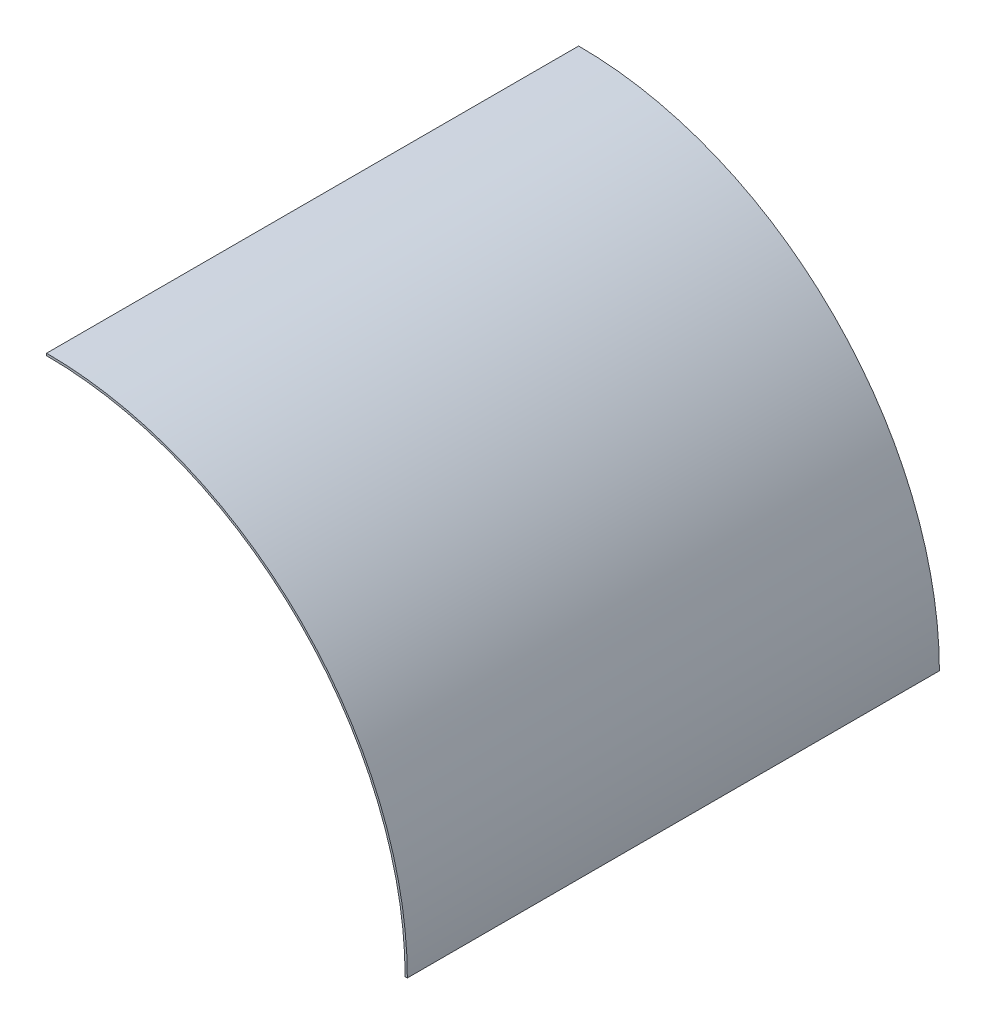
from build123d import *

# Parameters (mm, degrees)
BOSS_EXTRUDE1_DEPTH = 3000


with BuildPart() as part:
    # Sketch1 → Boss-Extrude1 (new body)
    with BuildSketch(Plane.XY):
        with BuildLine():
            Line((0, 2034), (0, 2021.5))
            ThreePointArc((0, 2021.5), (1429.416358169, 1429.416358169), (2021.5, 0))
            Line((2021.5, 0), (2034, 0))
            ThreePointArc((2034, 0), (1438.255192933, 1438.255192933), (0, 2034))
        make_face()
    extrude(amount=-BOSS_EXTRUDE1_DEPTH)


solid = part.part
